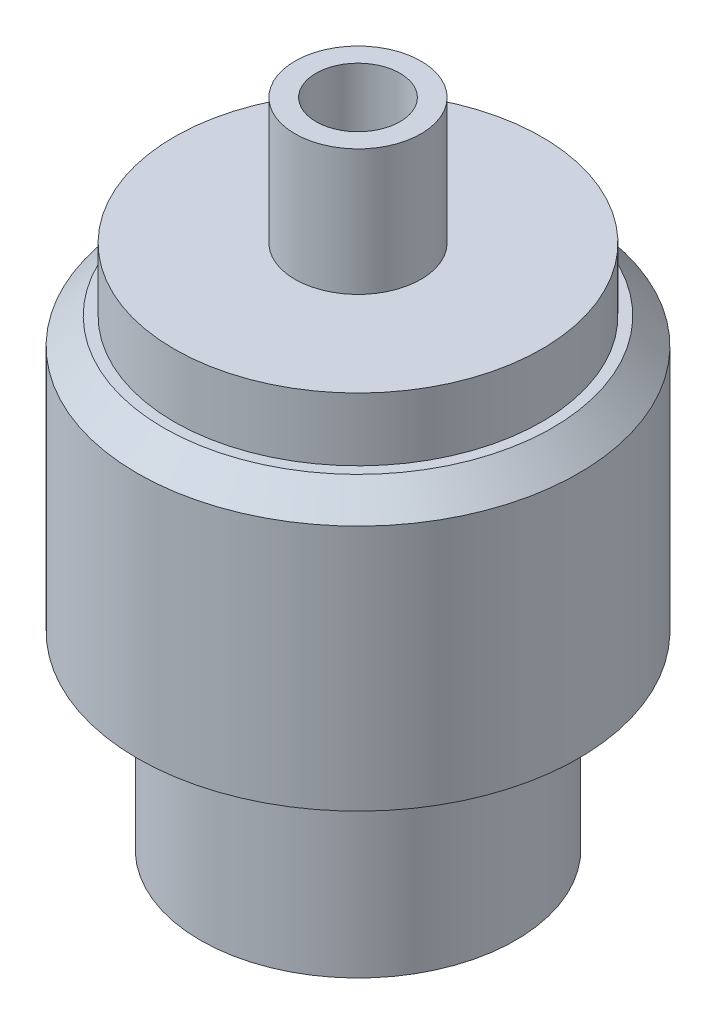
ISO-10303-21;
HEADER;
FILE_DESCRIPTION(('STEP AP214'),'2;1');
FILE_NAME('part.step','',(''),(''),'','','');
FILE_SCHEMA(('AUTOMOTIVE_DESIGN { 1 0 10303 214 1 1 1 1 }'));
ENDSEC;
DATA;
#1=APPLICATION_CONTEXT('core data for automotive mechanical design processes');
#2=APPLICATION_PROTOCOL_DEFINITION('international standard','automotive_design',2000,#1);
#3=PRODUCT_CONTEXT('',#1,'mechanical');
#4=PRODUCT('Part','Part','',(#3));
#5=PRODUCT_RELATED_PRODUCT_CATEGORY('part','',(#4));
#6=PRODUCT_DEFINITION_FORMATION('','',#4);
#7=PRODUCT_DEFINITION_CONTEXT('part definition',#1,'design');
#8=PRODUCT_DEFINITION('design','',#6,#7);
#9=PRODUCT_DEFINITION_SHAPE('','',#8);
#10=(LENGTH_UNIT() NAMED_UNIT(*) SI_UNIT(.MILLI.,.METRE.));
#11=(NAMED_UNIT(*) PLANE_ANGLE_UNIT() SI_UNIT($,.RADIAN.));
#12=(NAMED_UNIT(*) SI_UNIT($,.STERADIAN.) SOLID_ANGLE_UNIT());
#13=UNCERTAINTY_MEASURE_WITH_UNIT(LENGTH_MEASURE(1.E-05),#10,'distance_accuracy_value','');
#14=(GEOMETRIC_REPRESENTATION_CONTEXT(3) GLOBAL_UNCERTAINTY_ASSIGNED_CONTEXT((#13)) GLOBAL_UNIT_ASSIGNED_CONTEXT((#10,
#11,#12)) REPRESENTATION_CONTEXT('',''));
#15=CARTESIAN_POINT('',(0.,0.,0.));
#16=DIRECTION('',(0.,0.,1.));
#17=DIRECTION('',(1.,0.,0.));
#18=AXIS2_PLACEMENT_3D('',#15,#16,#17);
#19=CARTESIAN_POINT('',(0.,25.,0.));
#20=DIRECTION('',(0.,-1.,0.));
#21=DIRECTION('',(0.,0.,-1.));
#22=AXIS2_PLACEMENT_3D('',#19,#20,#21);
#23=CYLINDRICAL_SURFACE('',#22,10.5);
#24=CARTESIAN_POINT('',(0.,20.75,0.));
#25=DIRECTION('',(0.,1.,0.));
#26=DIRECTION('',(0.,0.,1.));
#27=AXIS2_PLACEMENT_3D('',#24,#25,#26);
#28=CIRCLE('',#27,10.5);
#29=CARTESIAN_POINT('',(0.,20.75,10.5));
#30=VERTEX_POINT('',#29);
#31=EDGE_CURVE('E11',#30,#30,#28,.F.);
#32=ORIENTED_EDGE('',*,*,#31,.T.);
#33=EDGE_LOOP('',(#32));
#34=FACE_BOUND('',#33,.T.);
#35=CARTESIAN_POINT('',(0.,9.,0.));
#36=DIRECTION('',(0.,-1.,0.));
#37=DIRECTION('',(0.,0.,-1.));
#38=AXIS2_PLACEMENT_3D('',#35,#36,#37);
#39=CIRCLE('',#38,10.5);
#40=CARTESIAN_POINT('',(0.,9.,-10.5));
#41=VERTEX_POINT('',#40);
#42=EDGE_CURVE('E47',#41,#41,#39,.F.);
#43=ORIENTED_EDGE('',*,*,#42,.T.);
#44=EDGE_LOOP('',(#43));
#45=FACE_BOUND('',#44,.T.);
#46=ADVANCED_FACE('F35',(#34,#45),#23,.T.);
#47=CARTESIAN_POINT('',(0.,25.,0.));
#48=DIRECTION('',(0.,1.,0.));
#49=DIRECTION('',(0.,0.,1.));
#50=AXIS2_PLACEMENT_3D('',#47,#48,#49);
#51=PLANE('',#50);
#52=CARTESIAN_POINT('',(0.,25.,0.));
#53=DIRECTION('',(0.,1.,0.));
#54=DIRECTION('',(0.,0.,1.));
#55=AXIS2_PLACEMENT_3D('',#52,#53,#54);
#56=CIRCLE('',#55,8.75);
#57=CARTESIAN_POINT('',(0.,25.,8.75));
#58=VERTEX_POINT('',#57);
#59=EDGE_CURVE('E56',#58,#58,#56,.T.);
#60=ORIENTED_EDGE('',*,*,#59,.T.);
#61=EDGE_LOOP('',(#60));
#62=FACE_BOUND('',#61,.T.);
#63=CARTESIAN_POINT('',(0.,25.,0.));
#64=DIRECTION('',(0.,1.,0.));
#65=DIRECTION('',(0.,0.,1.));
#66=AXIS2_PLACEMENT_3D('',#63,#64,#65);
#67=CIRCLE('',#66,3.);
#68=CARTESIAN_POINT('',(0.,25.,3.));
#69=VERTEX_POINT('',#68);
#70=EDGE_CURVE('E62',#69,#69,#67,.T.);
#71=ORIENTED_EDGE('',*,*,#70,.F.);
#72=EDGE_LOOP('',(#71));
#73=FACE_BOUND('',#72,.T.);
#74=ADVANCED_FACE('F99',(#62,#73),#51,.T.);
#75=CARTESIAN_POINT('',(0.,22.,0.));
#76=DIRECTION('',(0.,1.,0.));
#77=DIRECTION('',(0.,0.,1.));
#78=AXIS2_PLACEMENT_3D('',#75,#76,#77);
#79=PLANE('',#78);
#80=CARTESIAN_POINT('',(0.,22.,0.));
#81=DIRECTION('',(0.,1.,0.));
#82=DIRECTION('',(0.,0.,1.));
#83=AXIS2_PLACEMENT_3D('',#80,#81,#82);
#84=CIRCLE('',#83,9.25);
#85=CARTESIAN_POINT('',(0.,22.,9.25));
#86=VERTEX_POINT('',#85);
#87=EDGE_CURVE('E43',#86,#86,#84,.T.);
#88=ORIENTED_EDGE('',*,*,#87,.T.);
#89=EDGE_LOOP('',(#88));
#90=FACE_BOUND('',#89,.T.);
#91=CARTESIAN_POINT('',(0.,22.,0.));
#92=DIRECTION('',(0.,1.,0.));
#93=DIRECTION('',(0.,0.,1.));
#94=AXIS2_PLACEMENT_3D('',#91,#92,#93);
#95=CIRCLE('',#94,8.75);
#96=CARTESIAN_POINT('',(0.,22.,8.75));
#97=VERTEX_POINT('',#96);
#98=EDGE_CURVE('E55',#97,#97,#95,.T.);
#99=ORIENTED_EDGE('',*,*,#98,.F.);
#100=EDGE_LOOP('',(#99));
#101=FACE_BOUND('',#100,.T.);
#102=ADVANCED_FACE('F104',(#90,#101),#79,.T.);
#103=CARTESIAN_POINT('',(0.,22.,0.));
#104=DIRECTION('',(0.,1.,0.));
#105=DIRECTION('',(0.,0.,1.));
#106=AXIS2_PLACEMENT_3D('',#103,#104,#105);
#107=CYLINDRICAL_SURFACE('',#106,8.75);
#108=ORIENTED_EDGE('',*,*,#98,.T.);
#109=EDGE_LOOP('',(#108));
#110=FACE_BOUND('',#109,.T.);
#111=ORIENTED_EDGE('',*,*,#59,.F.);
#112=EDGE_LOOP('',(#111));
#113=FACE_BOUND('',#112,.T.);
#114=ADVANCED_FACE('F146',(#110,#113),#107,.T.);
#115=CARTESIAN_POINT('',(0.,31.,0.));
#116=DIRECTION('',(0.,-1.,0.));
#117=DIRECTION('',(0.,0.,-1.));
#118=AXIS2_PLACEMENT_3D('',#115,#116,#117);
#119=CYLINDRICAL_SURFACE('',#118,3.);
#120=CARTESIAN_POINT('',(0.,31.,0.));
#121=DIRECTION('',(0.,1.,0.));
#122=DIRECTION('',(0.,0.,1.));
#123=AXIS2_PLACEMENT_3D('',#120,#121,#122);
#124=CIRCLE('',#123,3.);
#125=CARTESIAN_POINT('',(0.,31.,3.));
#126=VERTEX_POINT('',#125);
#127=EDGE_CURVE('E59',#126,#126,#124,.T.);
#128=ORIENTED_EDGE('',*,*,#127,.F.);
#129=EDGE_LOOP('',(#128));
#130=FACE_BOUND('',#129,.T.);
#131=ORIENTED_EDGE('',*,*,#70,.T.);
#132=EDGE_LOOP('',(#131));
#133=FACE_BOUND('',#132,.T.);
#134=ADVANCED_FACE('F142',(#130,#133),#119,.T.);
#135=CARTESIAN_POINT('',(0.,31.,0.));
#136=DIRECTION('',(0.,1.,0.));
#137=DIRECTION('',(0.,0.,1.));
#138=AXIS2_PLACEMENT_3D('',#135,#136,#137);
#139=PLANE('',#138);
#140=CARTESIAN_POINT('',(0.,31.,0.));
#141=DIRECTION('',(0.,1.,0.));
#142=DIRECTION('',(0.,0.,1.));
#143=AXIS2_PLACEMENT_3D('',#140,#141,#142);
#144=CIRCLE('',#143,2.);
#145=CARTESIAN_POINT('',(0.,31.,2.));
#146=VERTEX_POINT('',#145);
#147=EDGE_CURVE('E79',#146,#146,#144,.T.);
#148=ORIENTED_EDGE('',*,*,#147,.F.);
#149=EDGE_LOOP('',(#148));
#150=FACE_BOUND('',#149,.T.);
#151=ORIENTED_EDGE('',*,*,#127,.T.);
#152=EDGE_LOOP('',(#151));
#153=FACE_BOUND('',#152,.T.);
#154=ADVANCED_FACE('F127',(#150,#153),#139,.T.);
#155=CARTESIAN_POINT('',(0.,7.5,0.));
#156=DIRECTION('',(0.,-1.,0.));
#157=DIRECTION('',(0.,0.,-1.));
#158=AXIS2_PLACEMENT_3D('',#155,#156,#157);
#159=PLANE('',#158);
#160=CARTESIAN_POINT('',(0.,7.5,0.));
#161=DIRECTION('',(0.,-1.,0.));
#162=DIRECTION('',(0.,0.,-1.));
#163=AXIS2_PLACEMENT_3D('',#160,#161,#162);
#164=CIRCLE('',#163,7.99999999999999);
#165=CARTESIAN_POINT('',(0.,7.5,-7.99999999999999));
#166=VERTEX_POINT('',#165);
#167=EDGE_CURVE('E52',#166,#166,#164,.T.);
#168=ORIENTED_EDGE('',*,*,#167,.T.);
#169=EDGE_LOOP('',(#168));
#170=FACE_BOUND('',#169,.T.);
#171=CARTESIAN_POINT('',(0.,7.5,0.));
#172=DIRECTION('',(0.,-1.,0.));
#173=DIRECTION('',(0.,0.,-1.));
#174=AXIS2_PLACEMENT_3D('',#171,#172,#173);
#175=CIRCLE('',#174,7.5);
#176=CARTESIAN_POINT('',(0.,7.5,-7.5));
#177=VERTEX_POINT('',#176);
#178=EDGE_CURVE('E65',#177,#177,#175,.T.);
#179=ORIENTED_EDGE('',*,*,#178,.F.);
#180=EDGE_LOOP('',(#179));
#181=FACE_BOUND('',#180,.T.);
#182=ADVANCED_FACE('F124',(#170,#181),#159,.T.);
#183=CARTESIAN_POINT('',(0.,7.5,0.));
#184=DIRECTION('',(0.,-1.,0.));
#185=DIRECTION('',(0.,0.,-1.));
#186=AXIS2_PLACEMENT_3D('',#183,#184,#185);
#187=CYLINDRICAL_SURFACE('',#186,7.5);
#188=ORIENTED_EDGE('',*,*,#178,.T.);
#189=EDGE_LOOP('',(#188));
#190=FACE_BOUND('',#189,.T.);
#191=CARTESIAN_POINT('',(0.,0.,0.));
#192=DIRECTION('',(0.,-1.,0.));
#193=DIRECTION('',(0.,0.,-1.));
#194=AXIS2_PLACEMENT_3D('',#191,#192,#193);
#195=CIRCLE('',#194,7.5);
#196=CARTESIAN_POINT('',(0.,0.,-7.5));
#197=VERTEX_POINT('',#196);
#198=EDGE_CURVE('E68',#197,#197,#195,.T.);
#199=ORIENTED_EDGE('',*,*,#198,.F.);
#200=EDGE_LOOP('',(#199));
#201=FACE_BOUND('',#200,.T.);
#202=ADVANCED_FACE('F118',(#190,#201),#187,.T.);
#203=CARTESIAN_POINT('',(0.,0.,0.));
#204=DIRECTION('',(0.,1.,0.));
#205=DIRECTION('',(0.,0.,1.));
#206=AXIS2_PLACEMENT_3D('',#203,#204,#205);
#207=PLANE('',#206);
#208=CARTESIAN_POINT('',(0.,0.,0.));
#209=DIRECTION('',(0.,-1.,0.));
#210=DIRECTION('',(0.,0.,-1.));
#211=AXIS2_PLACEMENT_3D('',#208,#209,#210);
#212=CIRCLE('',#211,3.5);
#213=CARTESIAN_POINT('',(0.,0.,-3.5));
#214=VERTEX_POINT('',#213);
#215=EDGE_CURVE('E76',#214,#214,#212,.T.);
#216=ORIENTED_EDGE('',*,*,#215,.F.);
#217=EDGE_LOOP('',(#216));
#218=FACE_BOUND('',#217,.T.);
#219=ORIENTED_EDGE('',*,*,#198,.T.);
#220=EDGE_LOOP('',(#219));
#221=FACE_BOUND('',#220,.T.);
#222=ADVANCED_FACE('F109',(#218,#221),#207,.F.);
#223=CARTESIAN_POINT('',(0.,7.5,0.));
#224=DIRECTION('',(0.,1.,0.));
#225=DIRECTION('',(0.,0.,1.));
#226=AXIS2_PLACEMENT_3D('',#223,#224,#225);
#227=CONICAL_SURFACE('',#226,7.99999999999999,1.03037682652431);
#228=ORIENTED_EDGE('',*,*,#42,.F.);
#229=EDGE_LOOP('',(#228));
#230=FACE_BOUND('',#229,.T.);
#231=ORIENTED_EDGE('',*,*,#167,.F.);
#232=EDGE_LOOP('',(#231));
#233=FACE_BOUND('',#232,.T.);
#234=ADVANCED_FACE('F110',(#230,#233),#227,.T.);
#235=CARTESIAN_POINT('',(0.,22.,0.));
#236=DIRECTION('',(0.,-1.,0.));
#237=DIRECTION('',(0.,0.,-1.));
#238=AXIS2_PLACEMENT_3D('',#235,#236,#237);
#239=CONICAL_SURFACE('',#238,9.25,0.785398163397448);
#240=ORIENTED_EDGE('',*,*,#31,.F.);
#241=EDGE_LOOP('',(#240));
#242=FACE_BOUND('',#241,.T.);
#243=ORIENTED_EDGE('',*,*,#87,.F.);
#244=EDGE_LOOP('',(#243));
#245=FACE_BOUND('',#244,.T.);
#246=ADVANCED_FACE('F37',(#242,#245),#239,.T.);
#247=CARTESIAN_POINT('',(0.,20.,0.));
#248=DIRECTION('',(0.,-1.,0.));
#249=DIRECTION('',(0.,0.,-1.));
#250=AXIS2_PLACEMENT_3D('',#247,#248,#249);
#251=CONICAL_SURFACE('',#250,3.5,1.0471975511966);
#252=CARTESIAN_POINT('',(0.,20.8660254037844,0.));
#253=DIRECTION('',(0.,-1.,0.));
#254=DIRECTION('',(0.,0.,-1.));
#255=AXIS2_PLACEMENT_3D('',#252,#253,#254);
#256=CIRCLE('',#255,2.);
#257=CARTESIAN_POINT('',(0.,20.8660254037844,-2.));
#258=VERTEX_POINT('',#257);
#259=EDGE_CURVE('E39',#258,#258,#256,.F.);
#260=ORIENTED_EDGE('',*,*,#259,.T.);
#261=EDGE_LOOP('',(#260));
#262=FACE_BOUND('',#261,.T.);
#263=CARTESIAN_POINT('',(0.,20.,0.));
#264=DIRECTION('',(0.,-1.,0.));
#265=DIRECTION('',(0.,0.,-1.));
#266=AXIS2_PLACEMENT_3D('',#263,#264,#265);
#267=CIRCLE('',#266,3.5);
#268=CARTESIAN_POINT('',(0.,20.,-3.5));
#269=VERTEX_POINT('',#268);
#270=EDGE_CURVE('E71',#269,#269,#267,.T.);
#271=ORIENTED_EDGE('',*,*,#270,.T.);
#272=EDGE_LOOP('',(#271));
#273=FACE_BOUND('',#272,.T.);
#274=ADVANCED_FACE('F86',(#262,#273),#251,.F.);
#275=CARTESIAN_POINT('',(0.,0.,0.));
#276=DIRECTION('',(0.,-1.,0.));
#277=DIRECTION('',(0.,0.,-1.));
#278=AXIS2_PLACEMENT_3D('',#275,#276,#277);
#279=CYLINDRICAL_SURFACE('',#278,3.5);
#280=ORIENTED_EDGE('',*,*,#270,.F.);
#281=EDGE_LOOP('',(#280));
#282=FACE_BOUND('',#281,.T.);
#283=ORIENTED_EDGE('',*,*,#215,.T.);
#284=EDGE_LOOP('',(#283));
#285=FACE_BOUND('',#284,.T.);
#286=ADVANCED_FACE('F91',(#282,#285),#279,.F.);
#287=CARTESIAN_POINT('',(0.,0.,0.));
#288=DIRECTION('',(0.,1.,0.));
#289=DIRECTION('',(0.,0.,1.));
#290=AXIS2_PLACEMENT_3D('',#287,#288,#289);
#291=CYLINDRICAL_SURFACE('',#290,2.);
#292=ORIENTED_EDGE('',*,*,#147,.T.);
#293=EDGE_LOOP('',(#292));
#294=FACE_BOUND('',#293,.T.);
#295=ORIENTED_EDGE('',*,*,#259,.F.);
#296=EDGE_LOOP('',(#295));
#297=FACE_BOUND('',#296,.T.);
#298=ADVANCED_FACE('F89',(#294,#297),#291,.F.);
#299=CLOSED_SHELL('',(#46,#74,#102,#114,#134,#154,#182,#202,#222,#234,#246,#274,#286,#298));
#300=MANIFOLD_SOLID_BREP('B2',#299);
#301=ADVANCED_BREP_SHAPE_REPRESENTATION('',(#18,#300),#14);
#302=SHAPE_DEFINITION_REPRESENTATION(#9,#301);
ENDSEC;
END-ISO-10303-21;
